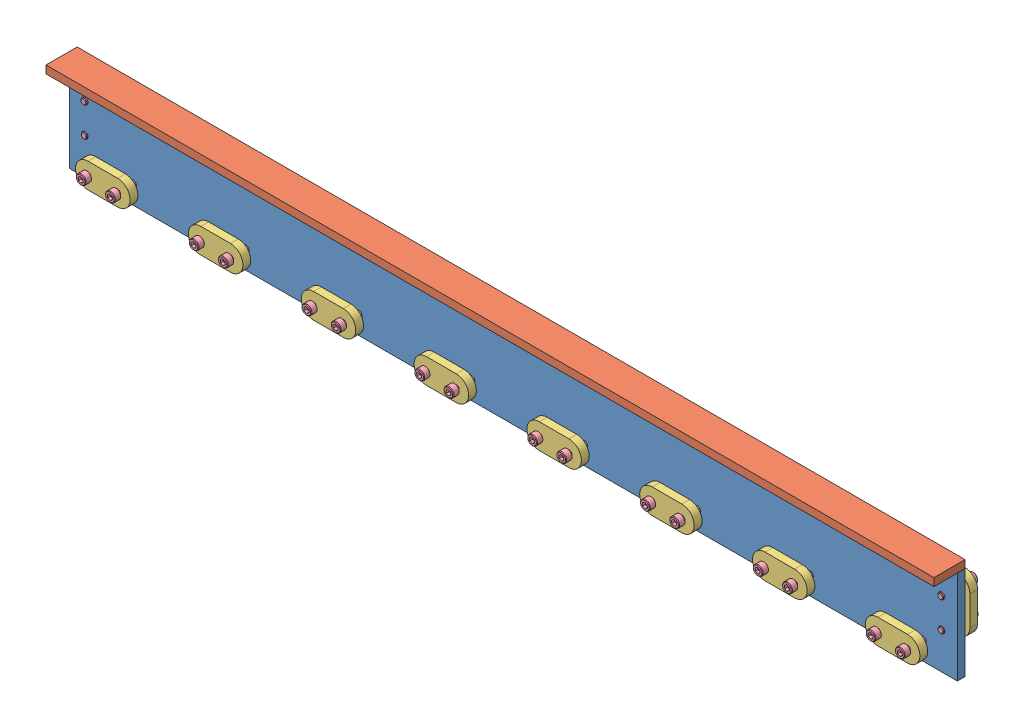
SolidWorks assembly fs-ua-left-mount-assembly-with-screws.SLDASM, configuration Default (file format 9000). Lengths in mm.
Overall size (723.9 82.55 45.12).
33 component instances, 4 part files, 6 mates.
Components (placement in the parent):
- fs-ua-left-mount-assembly-1: fs-ua-left-mount-assembly.SLDASM [Default] at origin size (723.9 82.55 38.15)
  - fs-ua-left-mount-vertical-component-1: fs-ua-left-mount-vertical-component.SLDPRT [Default] at origin size (723.9 76.2 6.35)
  - fs-ua-left-mount-horizontal-component-1: fs-ua-left-mount-horizontal-component.SLDPRT [Default] at (361.95 76.2 12.7) size (723.9 6.35 25.4)
  - fs-clamp-1: fs-clamp.SLDPRT [Default] at (27.94 15.24 12.7326) size (44.45 20.32 6.35)
  - fs-clamp-2: fs-clamp.SLDPRT [Default] at (12.7 29.845 -12.7409) x (0 1 0) z (0 0 1) size (44.45 20.32 6.35)
  - fs-clamp-3: fs-clamp.SLDPRT [Default] at (711.2 29.845 -6.3972) x (0 1 0) z (0 0 -1) size (44.45 20.32 6.35)
  - fs-clamp-4: fs-clamp.SLDPRT [Default] at (119.9243 15.24 12.7326) size (44.45 20.32 6.35)
  - fs-clamp-5: fs-clamp.SLDPRT [Default] at (211.9086 15.24 12.7326) size (44.45 20.32 6.35)
  - fs-clamp-6: fs-clamp.SLDPRT [Default] at (303.893 15.24 12.7326) size (44.45 20.32 6.35)
  - fs-clamp-7: fs-clamp.SLDPRT [Default] at (395.8773 15.24 12.7326) size (44.45 20.32 6.35)
  - fs-clamp-8: fs-clamp.SLDPRT [Default] at (487.8616 15.24 12.7326) size (44.45 20.32 6.35)
  - fs-clamp-9: fs-clamp.SLDPRT [Default] at (579.8459 15.24 12.7326) size (44.45 20.32 6.35)
  - fs-clamp-10: fs-clamp.SLDPRT [Default] at (671.8303 15.24 12.7326) size (44.45 20.32 6.35)
- socket head cap screw_ai-1: socket head cap screw_ai.sldprt [HX-SHCS 0.19-32x0.875x0.875-N] at (27.94 15.24 25.0524) x (0 0 -1) z (-0.570283 0.821448 0) size (27.05 7.94 7.94)
- socket head cap screw_ai-2: socket head cap screw_ai.sldprt [HX-SHCS 0.19-32x0.875x0.875-N] at (711.2 53.975 -19.4006) x (0 0 1) z (-0.954871 -0.29702 0) size (27.05 7.94 7.94)
- socket head cap screw_ai-3: socket head cap screw_ai.sldprt [HX-SHCS 0.19-32x0.875x0.875-N] at (711.2 29.845 -19.7235) x (0 0 1) z (-0.178736 -0.983897 0) size (27.05 7.94 7.94)
- socket head cap screw_ai-4: socket head cap screw_ai.sldprt [HX-SHCS 0.19-32x0.875x0.875-N] at (12.7 53.975 -19.387) x (0 0 1) z (0.231262 0.972891 0) size (27.05 7.94 7.94)
- socket head cap screw_ai-5: socket head cap screw_ai.sldprt [HX-SHCS 0.19-32x0.875x0.875-N] at (12.7 29.845 -19.6757) x (0 0 1) z (-0.841681 -0.539975 0) size (27.05 7.94 7.94)
- socket head cap screw_ai-6: socket head cap screw_ai.sldprt [HX-SHCS 0.19-32x0.875x0.875-N] at (52.07 15.24 25.3347) x (0 0 -1) z (0.61191 -0.790927 0) size (27.05 7.94 7.94)
- socket head cap screw_ai-7: socket head cap screw_ai.sldprt [HX-SHCS 0.19-32x0.875x0.875-N] at (119.9251 15.24 25.0524) x (0 0 -1) z (-0.570283 0.821448 0) size (27.05 7.94 7.94)
- socket head cap screw_ai-8: socket head cap screw_ai.sldprt [HX-SHCS 0.19-32x0.875x0.875-N] at (211.9102 15.24 25.0524) x (0 0 -1) z (-0.570283 0.821448 0) size (27.05 7.94 7.94)
- socket head cap screw_ai-9: socket head cap screw_ai.sldprt [HX-SHCS 0.19-32x0.875x0.875-N] at (303.8953 15.24 25.0524) x (0 0 -1) z (-0.570283 0.821448 0) size (27.05 7.94 7.94)
- socket head cap screw_ai-10: socket head cap screw_ai.sldprt [HX-SHCS 0.19-32x0.875x0.875-N] at (395.8803 15.24 25.0524) x (0 0 -1) z (-0.570283 0.821448 0) size (27.05 7.94 7.94)
- socket head cap screw_ai-11: socket head cap screw_ai.sldprt [HX-SHCS 0.19-32x0.875x0.875-N] at (487.8654 15.24 25.0524) x (0 0 -1) z (-0.570283 0.821448 0) size (27.05 7.94 7.94)
- socket head cap screw_ai-12: socket head cap screw_ai.sldprt [HX-SHCS 0.19-32x0.875x0.875-N] at (579.8505 15.24 25.0524) x (0 0 -1) z (-0.570283 0.821448 0) size (27.05 7.94 7.94)
- socket head cap screw_ai-13: socket head cap screw_ai.sldprt [HX-SHCS 0.19-32x0.875x0.875-N] at (671.8356 15.24 25.0524) x (0 0 -1) z (-0.570283 0.821448 0) size (27.05 7.94 7.94)
- socket head cap screw_ai-14: socket head cap screw_ai.sldprt [HX-SHCS 0.19-32x0.875x0.875-N] at (144.0551 15.24 25.3347) x (0 0 -1) z (0.61191 -0.790927 0) size (27.05 7.94 7.94)
- socket head cap screw_ai-15: socket head cap screw_ai.sldprt [HX-SHCS 0.19-32x0.875x0.875-N] at (236.0402 15.24 25.3347) x (0 0 -1) z (0.61191 -0.790927 0) size (27.05 7.94 7.94)
- socket head cap screw_ai-16: socket head cap screw_ai.sldprt [HX-SHCS 0.19-32x0.875x0.875-N] at (328.0253 15.24 25.3347) x (0 0 -1) z (0.61191 -0.790927 0) size (27.05 7.94 7.94)
- socket head cap screw_ai-17: socket head cap screw_ai.sldprt [HX-SHCS 0.19-32x0.875x0.875-N] at (420.0103 15.24 25.3347) x (0 0 -1) z (0.61191 -0.790927 0) size (27.05 7.94 7.94)
- socket head cap screw_ai-18: socket head cap screw_ai.sldprt [HX-SHCS 0.19-32x0.875x0.875-N] at (511.9954 15.24 25.3347) x (0 0 -1) z (0.61191 -0.790927 0) size (27.05 7.94 7.94)
- socket head cap screw_ai-19: socket head cap screw_ai.sldprt [HX-SHCS 0.19-32x0.875x0.875-N] at (603.9805 15.24 25.3347) x (0 0 -1) z (0.61191 -0.790927 0) size (27.05 7.94 7.94)
- socket head cap screw_ai-20: socket head cap screw_ai.sldprt [HX-SHCS 0.19-32x0.875x0.875-N] at (695.9656 15.24 25.3347) x (0 0 -1) z (0.61191 -0.790927 0) size (27.05 7.94 7.94)
Mates (geometry in assembly coordinates):
- Concentric3: concentric anti-aligned: cylinder of fs-ua-left-mount-assembly-1/fs-clamp-1 through (27.94 15.24 19.0826) axis (0 0 -1) radius 2.54; cylinder of socket head cap screw_ai-1 through (27.94 15.24 56.8024) axis (0 0 1) radius 2.413
- Concentric4: concentric anti-aligned: cylinder of fs-ua-left-mount-assembly-1/fs-clamp-1 through (52.07 15.24 19.0826) axis (0 0 -1) radius 2.54; cylinder of socket head cap screw_ai-6 through (52.07 15.24 57.0847) axis (0 0 1) radius 2.413
- Concentric7: concentric anti-aligned: cylinder of fs-ua-left-mount-assembly-1/fs-clamp-3 through (711.2 53.975 -12.7472) axis (0 0 1) radius 2.54; cylinder of socket head cap screw_ai-2 through (711.2 53.975 -51.1506) axis (0 0 -1) radius 2.413
- Concentric9: concentric anti-aligned: cylinder of fs-ua-left-mount-assembly-1/fs-clamp-3 through (711.2 29.845 -12.7472) axis (0 0 1) radius 2.54; cylinder of socket head cap screw_ai-3 through (711.2 29.845 -51.4735) axis (0 0 -1) radius 2.413
- Concentric10: concentric aligned: cylinder of fs-ua-left-mount-assembly-1/fs-clamp-2 through (12.7 53.975 -6.3909) axis (0 0 -1) radius 2.54; cylinder of socket head cap screw_ai-4 through (12.7 53.975 -51.137) axis (0 0 -1) radius 2.413
- Concentric11: concentric aligned: cylinder of fs-ua-left-mount-assembly-1/fs-clamp-2 through (12.7 29.845 -6.3909) axis (0 0 -1) radius 2.54; cylinder of socket head cap screw_ai-5 through (12.7 29.845 -51.4257) axis (0 0 -1) radius 2.413
